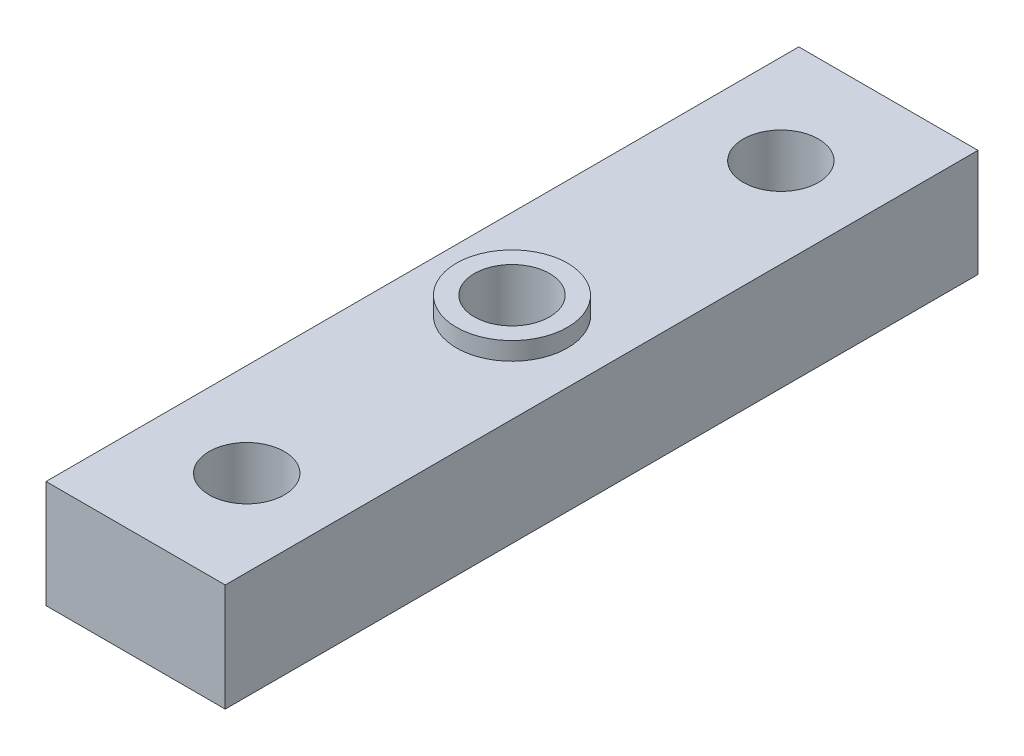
ISO-10303-21;
HEADER;
FILE_DESCRIPTION(('STEP AP214'),'2;1');
FILE_NAME('part.step','',(''),(''),'','','');
FILE_SCHEMA(('AUTOMOTIVE_DESIGN { 1 0 10303 214 1 1 1 1 }'));
ENDSEC;
DATA;
#1=APPLICATION_CONTEXT('core data for automotive mechanical design processes');
#2=APPLICATION_PROTOCOL_DEFINITION('international standard','automotive_design',2000,#1);
#3=PRODUCT_CONTEXT('',#1,'mechanical');
#4=PRODUCT('Part','Part','',(#3));
#5=PRODUCT_RELATED_PRODUCT_CATEGORY('part','',(#4));
#6=PRODUCT_DEFINITION_FORMATION('','',#4);
#7=PRODUCT_DEFINITION_CONTEXT('part definition',#1,'design');
#8=PRODUCT_DEFINITION('design','',#6,#7);
#9=PRODUCT_DEFINITION_SHAPE('','',#8);
#10=(LENGTH_UNIT() NAMED_UNIT(*) SI_UNIT(.MILLI.,.METRE.));
#11=(NAMED_UNIT(*) PLANE_ANGLE_UNIT() SI_UNIT($,.RADIAN.));
#12=(NAMED_UNIT(*) SI_UNIT($,.STERADIAN.) SOLID_ANGLE_UNIT());
#13=UNCERTAINTY_MEASURE_WITH_UNIT(LENGTH_MEASURE(1.E-05),#10,'distance_accuracy_value','');
#14=(GEOMETRIC_REPRESENTATION_CONTEXT(3) GLOBAL_UNCERTAINTY_ASSIGNED_CONTEXT((#13)) GLOBAL_UNIT_ASSIGNED_CONTEXT((#10,
#11,#12)) REPRESENTATION_CONTEXT('',''));
#15=CARTESIAN_POINT('',(0.,0.,0.));
#16=DIRECTION('',(0.,0.,1.));
#17=DIRECTION('',(1.,0.,0.));
#18=AXIS2_PLACEMENT_3D('',#15,#16,#17);
#19=CARTESIAN_POINT('',(0.,6.,0.));
#20=DIRECTION('',(0.,-1.,0.));
#21=DIRECTION('',(0.,0.,-1.));
#22=AXIS2_PLACEMENT_3D('',#19,#20,#21);
#23=PLANE('',#22);
#24=CARTESIAN_POINT('',(5.,6.,-35.998668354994));
#25=DIRECTION('',(0.,1.,0.));
#26=DIRECTION('',(0.,0.,1.));
#27=AXIS2_PLACEMENT_3D('',#24,#25,#26);
#28=CIRCLE('',#27,2.1);
#29=CARTESIAN_POINT('',(5.,6.,-33.898668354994));
#30=VERTEX_POINT('',#29);
#31=EDGE_CURVE('E126',#30,#30,#28,.T.);
#32=ORIENTED_EDGE('',*,*,#31,.F.);
#33=EDGE_LOOP('',(#32));
#34=FACE_BOUND('',#33,.T.);
#35=CARTESIAN_POINT('',(5.19986889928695,6.,-6.));
#36=DIRECTION('',(0.,1.,0.));
#37=DIRECTION('',(0.,0.,1.));
#38=AXIS2_PLACEMENT_3D('',#35,#36,#37);
#39=CIRCLE('',#38,2.1);
#40=CARTESIAN_POINT('',(5.19986889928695,6.,-3.9));
#41=VERTEX_POINT('',#40);
#42=EDGE_CURVE('E105',#41,#41,#39,.T.);
#43=ORIENTED_EDGE('',*,*,#42,.F.);
#44=EDGE_LOOP('',(#43));
#45=FACE_BOUND('',#44,.T.);
#46=DIRECTION('',(0.,0.,1.));
#47=VECTOR('',#46,1.);
#48=CARTESIAN_POINT('',(0.,6.,0.));
#49=LINE('',#48,#47);
#50=CARTESIAN_POINT('',(0.,6.,-41.998668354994));
#51=VERTEX_POINT('',#50);
#52=CARTESIAN_POINT('',(0.,6.,0.));
#53=VERTEX_POINT('',#52);
#54=EDGE_CURVE('E88',#51,#53,#49,.T.);
#55=ORIENTED_EDGE('',*,*,#54,.T.);
#56=DIRECTION('',(1.,0.,0.));
#57=VECTOR('',#56,1.);
#58=CARTESIAN_POINT('',(0.,6.,0.));
#59=LINE('',#58,#57);
#60=CARTESIAN_POINT('',(10.,6.,0.));
#61=VERTEX_POINT('',#60);
#62=EDGE_CURVE('E83',#53,#61,#59,.T.);
#63=ORIENTED_EDGE('',*,*,#62,.T.);
#64=DIRECTION('',(0.,0.,-1.));
#65=VECTOR('',#64,1.);
#66=CARTESIAN_POINT('',(10.,6.,0.));
#67=LINE('',#66,#65);
#68=CARTESIAN_POINT('',(10.,6.,-41.998668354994));
#69=VERTEX_POINT('',#68);
#70=EDGE_CURVE('E86',#61,#69,#67,.T.);
#71=ORIENTED_EDGE('',*,*,#70,.T.);
#72=DIRECTION('',(-1.,0.,0.));
#73=VECTOR('',#72,1.);
#74=CARTESIAN_POINT('',(0.,6.,-41.998668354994));
#75=LINE('',#74,#73);
#76=EDGE_CURVE('E52',#69,#51,#75,.T.);
#77=ORIENTED_EDGE('',*,*,#76,.T.);
#78=EDGE_LOOP('',(#55,#63,#71,#77));
#79=FACE_BOUND('',#78,.T.);
#80=CARTESIAN_POINT('',(5.,6.,-20.998668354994));
#81=DIRECTION('',(0.,-1.,0.));
#82=DIRECTION('',(0.,0.,-1.));
#83=AXIS2_PLACEMENT_3D('',#80,#81,#82);
#84=CIRCLE('',#83,3.1);
#85=CARTESIAN_POINT('',(5.,6.,-24.098668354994));
#86=VERTEX_POINT('',#85);
#87=EDGE_CURVE('E11',#86,#86,#84,.F.);
#88=ORIENTED_EDGE('',*,*,#87,.F.);
#89=EDGE_LOOP('',(#88));
#90=FACE_BOUND('',#89,.T.);
#91=ADVANCED_FACE('F35',(#34,#45,#79,#90),#23,.F.);
#92=CARTESIAN_POINT('',(0.,0.,0.));
#93=DIRECTION('',(0.,-1.,0.));
#94=DIRECTION('',(0.,0.,-1.));
#95=AXIS2_PLACEMENT_3D('',#92,#93,#94);
#96=PLANE('',#95);
#97=CARTESIAN_POINT('',(5.,0.,-20.998668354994));
#98=DIRECTION('',(0.,1.,0.));
#99=DIRECTION('',(0.,0.,1.));
#100=AXIS2_PLACEMENT_3D('',#97,#98,#99);
#101=CIRCLE('',#100,2.1);
#102=CARTESIAN_POINT('',(5.,0.,-18.898668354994));
#103=VERTEX_POINT('',#102);
#104=EDGE_CURVE('E130',#103,#103,#101,.T.);
#105=ORIENTED_EDGE('',*,*,#104,.T.);
#106=EDGE_LOOP('',(#105));
#107=FACE_BOUND('',#106,.T.);
#108=DIRECTION('',(0.,0.,1.));
#109=VECTOR('',#108,1.);
#110=CARTESIAN_POINT('',(0.,0.,0.));
#111=LINE('',#110,#109);
#112=CARTESIAN_POINT('',(0.,0.,-41.998668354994));
#113=VERTEX_POINT('',#112);
#114=CARTESIAN_POINT('',(0.,0.,0.));
#115=VERTEX_POINT('',#114);
#116=EDGE_CURVE('E102',#113,#115,#111,.T.);
#117=ORIENTED_EDGE('',*,*,#116,.F.);
#118=DIRECTION('',(-1.,0.,0.));
#119=VECTOR('',#118,1.);
#120=CARTESIAN_POINT('',(0.,0.,-41.998668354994));
#121=LINE('',#120,#119);
#122=CARTESIAN_POINT('',(10.,0.,-41.998668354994));
#123=VERTEX_POINT('',#122);
#124=EDGE_CURVE('E75',#123,#113,#121,.T.);
#125=ORIENTED_EDGE('',*,*,#124,.F.);
#126=DIRECTION('',(0.,0.,-1.));
#127=VECTOR('',#126,1.);
#128=CARTESIAN_POINT('',(10.,0.,0.));
#129=LINE('',#128,#127);
#130=CARTESIAN_POINT('',(10.,0.,0.));
#131=VERTEX_POINT('',#130);
#132=EDGE_CURVE('E69',#131,#123,#129,.T.);
#133=ORIENTED_EDGE('',*,*,#132,.F.);
#134=DIRECTION('',(1.,0.,0.));
#135=VECTOR('',#134,1.);
#136=CARTESIAN_POINT('',(0.,0.,0.));
#137=LINE('',#136,#135);
#138=EDGE_CURVE('E93',#115,#131,#137,.T.);
#139=ORIENTED_EDGE('',*,*,#138,.F.);
#140=EDGE_LOOP('',(#117,#125,#133,#139));
#141=FACE_BOUND('',#140,.T.);
#142=CARTESIAN_POINT('',(5.19986889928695,0.,-6.));
#143=DIRECTION('',(0.,1.,0.));
#144=DIRECTION('',(0.,0.,1.));
#145=AXIS2_PLACEMENT_3D('',#142,#143,#144);
#146=CIRCLE('',#145,2.1);
#147=CARTESIAN_POINT('',(5.19986889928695,0.,-3.9));
#148=VERTEX_POINT('',#147);
#149=EDGE_CURVE('E121',#148,#148,#146,.T.);
#150=ORIENTED_EDGE('',*,*,#149,.T.);
#151=EDGE_LOOP('',(#150));
#152=FACE_BOUND('',#151,.T.);
#153=CARTESIAN_POINT('',(5.,0.,-35.998668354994));
#154=DIRECTION('',(0.,1.,0.));
#155=DIRECTION('',(0.,0.,1.));
#156=AXIS2_PLACEMENT_3D('',#153,#154,#155);
#157=CIRCLE('',#156,2.1);
#158=CARTESIAN_POINT('',(5.,0.,-33.898668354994));
#159=VERTEX_POINT('',#158);
#160=EDGE_CURVE('E124',#159,#159,#157,.T.);
#161=ORIENTED_EDGE('',*,*,#160,.T.);
#162=EDGE_LOOP('',(#161));
#163=FACE_BOUND('',#162,.T.);
#164=ADVANCED_FACE('F113',(#107,#141,#152,#163),#96,.T.);
#165=CARTESIAN_POINT('',(0.,6.,0.));
#166=DIRECTION('',(1.,0.,0.));
#167=DIRECTION('',(0.,0.,-1.));
#168=AXIS2_PLACEMENT_3D('',#165,#166,#167);
#169=PLANE('',#168);
#170=ORIENTED_EDGE('',*,*,#116,.T.);
#171=DIRECTION('',(0.,-1.,0.));
#172=VECTOR('',#171,1.);
#173=CARTESIAN_POINT('',(0.,6.,0.));
#174=LINE('',#173,#172);
#175=EDGE_CURVE('E44',#53,#115,#174,.T.);
#176=ORIENTED_EDGE('',*,*,#175,.F.);
#177=ORIENTED_EDGE('',*,*,#54,.F.);
#178=DIRECTION('',(0.,-1.,0.));
#179=VECTOR('',#178,1.);
#180=CARTESIAN_POINT('',(0.,6.,-41.998668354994));
#181=LINE('',#180,#179);
#182=EDGE_CURVE('E98',#51,#113,#181,.T.);
#183=ORIENTED_EDGE('',*,*,#182,.T.);
#184=EDGE_LOOP('',(#170,#176,#177,#183));
#185=FACE_BOUND('',#184,.T.);
#186=ADVANCED_FACE('F37',(#185),#169,.F.);
#187=CARTESIAN_POINT('',(0.,6.,0.));
#188=DIRECTION('',(0.,0.,-1.));
#189=DIRECTION('',(-1.,0.,0.));
#190=AXIS2_PLACEMENT_3D('',#187,#188,#189);
#191=PLANE('',#190);
#192=ORIENTED_EDGE('',*,*,#138,.T.);
#193=DIRECTION('',(0.,-1.,0.));
#194=VECTOR('',#193,1.);
#195=CARTESIAN_POINT('',(10.,6.,0.));
#196=LINE('',#195,#194);
#197=EDGE_CURVE('E91',#61,#131,#196,.T.);
#198=ORIENTED_EDGE('',*,*,#197,.F.);
#199=ORIENTED_EDGE('',*,*,#62,.F.);
#200=ORIENTED_EDGE('',*,*,#175,.T.);
#201=EDGE_LOOP('',(#192,#198,#199,#200));
#202=FACE_BOUND('',#201,.T.);
#203=ADVANCED_FACE('F92',(#202),#191,.F.);
#204=CARTESIAN_POINT('',(10.,6.,0.));
#205=DIRECTION('',(-1.,0.,0.));
#206=DIRECTION('',(0.,0.,1.));
#207=AXIS2_PLACEMENT_3D('',#204,#205,#206);
#208=PLANE('',#207);
#209=ORIENTED_EDGE('',*,*,#132,.T.);
#210=DIRECTION('',(0.,-1.,0.));
#211=VECTOR('',#210,1.);
#212=CARTESIAN_POINT('',(10.,6.,-41.998668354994));
#213=LINE('',#212,#211);
#214=EDGE_CURVE('E94',#69,#123,#213,.T.);
#215=ORIENTED_EDGE('',*,*,#214,.F.);
#216=ORIENTED_EDGE('',*,*,#70,.F.);
#217=ORIENTED_EDGE('',*,*,#197,.T.);
#218=EDGE_LOOP('',(#209,#215,#216,#217));
#219=FACE_BOUND('',#218,.T.);
#220=ADVANCED_FACE('F96',(#219),#208,.F.);
#221=CARTESIAN_POINT('',(0.,6.,-41.998668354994));
#222=DIRECTION('',(0.,0.,1.));
#223=DIRECTION('',(1.,0.,0.));
#224=AXIS2_PLACEMENT_3D('',#221,#222,#223);
#225=PLANE('',#224);
#226=ORIENTED_EDGE('',*,*,#124,.T.);
#227=ORIENTED_EDGE('',*,*,#182,.F.);
#228=ORIENTED_EDGE('',*,*,#76,.F.);
#229=ORIENTED_EDGE('',*,*,#214,.T.);
#230=EDGE_LOOP('',(#226,#227,#228,#229));
#231=FACE_BOUND('',#230,.T.);
#232=ADVANCED_FACE('F156',(#231),#225,.F.);
#233=CARTESIAN_POINT('',(5.19986889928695,6.,-6.));
#234=DIRECTION('',(0.,-1.,0.));
#235=DIRECTION('',(0.,0.,-1.));
#236=AXIS2_PLACEMENT_3D('',#233,#234,#235);
#237=CYLINDRICAL_SURFACE('',#236,2.1);
#238=ORIENTED_EDGE('',*,*,#42,.T.);
#239=EDGE_LOOP('',(#238));
#240=FACE_BOUND('',#239,.T.);
#241=ORIENTED_EDGE('',*,*,#149,.F.);
#242=EDGE_LOOP('',(#241));
#243=FACE_BOUND('',#242,.T.);
#244=ADVANCED_FACE('F142',(#240,#243),#237,.F.);
#245=CARTESIAN_POINT('',(5.,6.,-20.998668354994));
#246=DIRECTION('',(0.,-1.,0.));
#247=DIRECTION('',(0.,0.,-1.));
#248=AXIS2_PLACEMENT_3D('',#245,#246,#247);
#249=CYLINDRICAL_SURFACE('',#248,2.1);
#250=ORIENTED_EDGE('',*,*,#104,.F.);
#251=EDGE_LOOP('',(#250));
#252=FACE_BOUND('',#251,.T.);
#253=CARTESIAN_POINT('',(5.,7.,-20.998668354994));
#254=DIRECTION('',(0.,1.,0.));
#255=DIRECTION('',(0.,0.,1.));
#256=AXIS2_PLACEMENT_3D('',#253,#254,#255);
#257=CIRCLE('',#256,2.1);
#258=CARTESIAN_POINT('',(5.,7.,-18.898668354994));
#259=VERTEX_POINT('',#258);
#260=EDGE_CURVE('E133',#259,#259,#257,.T.);
#261=ORIENTED_EDGE('',*,*,#260,.T.);
#262=EDGE_LOOP('',(#261));
#263=FACE_BOUND('',#262,.T.);
#264=ADVANCED_FACE('F196',(#252,#263),#249,.F.);
#265=CARTESIAN_POINT('',(5.,6.,-35.998668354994));
#266=DIRECTION('',(0.,-1.,0.));
#267=DIRECTION('',(0.,0.,-1.));
#268=AXIS2_PLACEMENT_3D('',#265,#266,#267);
#269=CYLINDRICAL_SURFACE('',#268,2.1);
#270=ORIENTED_EDGE('',*,*,#31,.T.);
#271=EDGE_LOOP('',(#270));
#272=FACE_BOUND('',#271,.T.);
#273=ORIENTED_EDGE('',*,*,#160,.F.);
#274=EDGE_LOOP('',(#273));
#275=FACE_BOUND('',#274,.T.);
#276=ADVANCED_FACE('F203',(#272,#275),#269,.F.);
#277=CARTESIAN_POINT('',(5.,7.,-20.998668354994));
#278=DIRECTION('',(0.,1.,0.));
#279=DIRECTION('',(0.,0.,1.));
#280=AXIS2_PLACEMENT_3D('',#277,#278,#279);
#281=PLANE('',#280);
#282=CARTESIAN_POINT('',(5.,7.,-20.998668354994));
#283=DIRECTION('',(0.,1.,0.));
#284=DIRECTION('',(0.,0.,1.));
#285=AXIS2_PLACEMENT_3D('',#282,#283,#284);
#286=CIRCLE('',#285,3.1);
#287=CARTESIAN_POINT('',(5.,7.,-17.898668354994));
#288=VERTEX_POINT('',#287);
#289=EDGE_CURVE('E127',#288,#288,#286,.T.);
#290=ORIENTED_EDGE('',*,*,#289,.T.);
#291=EDGE_LOOP('',(#290));
#292=FACE_BOUND('',#291,.T.);
#293=ORIENTED_EDGE('',*,*,#260,.F.);
#294=EDGE_LOOP('',(#293));
#295=FACE_BOUND('',#294,.T.);
#296=ADVANCED_FACE('F211',(#292,#295),#281,.T.);
#297=CARTESIAN_POINT('',(5.,7.,-20.998668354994));
#298=DIRECTION('',(0.,-1.,0.));
#299=DIRECTION('',(0.,0.,-1.));
#300=AXIS2_PLACEMENT_3D('',#297,#298,#299);
#301=CYLINDRICAL_SURFACE('',#300,3.1);
#302=ORIENTED_EDGE('',*,*,#289,.F.);
#303=EDGE_LOOP('',(#302));
#304=FACE_BOUND('',#303,.T.);
#305=ORIENTED_EDGE('',*,*,#87,.T.);
#306=EDGE_LOOP('',(#305));
#307=FACE_BOUND('',#306,.T.);
#308=ADVANCED_FACE('F226',(#304,#307),#301,.T.);
#309=CLOSED_SHELL('',(#91,#164,#186,#203,#220,#232,#244,#264,#276,#296,#308));
#310=MANIFOLD_SOLID_BREP('B2',#309);
#311=ADVANCED_BREP_SHAPE_REPRESENTATION('',(#18,#310),#14);
#312=SHAPE_DEFINITION_REPRESENTATION(#9,#311);
ENDSEC;
END-ISO-10303-21;
